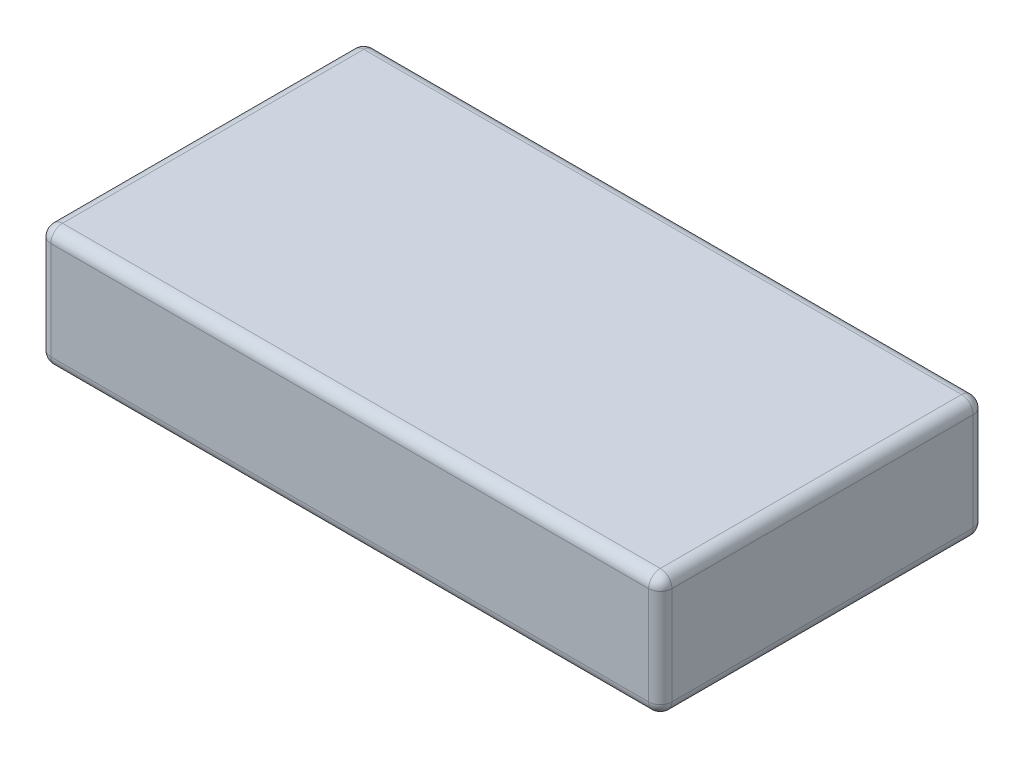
ISO-10303-21;
HEADER;
FILE_DESCRIPTION(('STEP AP214'),'2;1');
FILE_NAME('part.step','',(''),(''),'','','');
FILE_SCHEMA(('AUTOMOTIVE_DESIGN { 1 0 10303 214 1 1 1 1 }'));
ENDSEC;
DATA;
#1=APPLICATION_CONTEXT('core data for automotive mechanical design processes');
#2=APPLICATION_PROTOCOL_DEFINITION('international standard','automotive_design',2000,#1);
#3=PRODUCT_CONTEXT('',#1,'mechanical');
#4=PRODUCT('Part','Part','',(#3));
#5=PRODUCT_RELATED_PRODUCT_CATEGORY('part','',(#4));
#6=PRODUCT_DEFINITION_FORMATION('','',#4);
#7=PRODUCT_DEFINITION_CONTEXT('part definition',#1,'design');
#8=PRODUCT_DEFINITION('design','',#6,#7);
#9=PRODUCT_DEFINITION_SHAPE('','',#8);
#10=(LENGTH_UNIT() NAMED_UNIT(*) SI_UNIT(.MILLI.,.METRE.));
#11=(NAMED_UNIT(*) PLANE_ANGLE_UNIT() SI_UNIT($,.RADIAN.));
#12=(NAMED_UNIT(*) SI_UNIT($,.STERADIAN.) SOLID_ANGLE_UNIT());
#13=UNCERTAINTY_MEASURE_WITH_UNIT(LENGTH_MEASURE(1.E-05),#10,'distance_accuracy_value','');
#14=(GEOMETRIC_REPRESENTATION_CONTEXT(3) GLOBAL_UNCERTAINTY_ASSIGNED_CONTEXT((#13)) GLOBAL_UNIT_ASSIGNED_CONTEXT((#10,
#11,#12)) REPRESENTATION_CONTEXT('',''));
#15=CARTESIAN_POINT('',(0.,0.,0.));
#16=DIRECTION('',(0.,0.,1.));
#17=DIRECTION('',(1.,0.,0.));
#18=AXIS2_PLACEMENT_3D('',#15,#16,#17);
#19=CARTESIAN_POINT('',(26.6,10.4,13.9));
#20=DIRECTION('',(-1.,0.,0.));
#21=DIRECTION('',(0.,0.,1.));
#22=AXIS2_PLACEMENT_3D('',#19,#20,#21);
#23=PLANE('',#22);
#24=DIRECTION('',(0.,0.,-1.));
#25=VECTOR('',#24,1.);
#26=CARTESIAN_POINT('',(26.6,1.,-13.9));
#27=LINE('',#26,#25);
#28=CARTESIAN_POINT('',(26.6,1.,12.9));
#29=VERTEX_POINT('',#28);
#30=CARTESIAN_POINT('',(26.6,1.,-12.9));
#31=VERTEX_POINT('',#30);
#32=EDGE_CURVE('E227',#29,#31,#27,.T.);
#33=ORIENTED_EDGE('',*,*,#32,.T.);
#34=DIRECTION('',(0.,-1.,0.));
#35=VECTOR('',#34,1.);
#36=CARTESIAN_POINT('',(26.6,10.4,-12.9));
#37=LINE('',#36,#35);
#38=CARTESIAN_POINT('',(26.6,9.4,-12.9));
#39=VERTEX_POINT('',#38);
#40=EDGE_CURVE('E231',#31,#39,#37,.F.);
#41=ORIENTED_EDGE('',*,*,#40,.T.);
#42=DIRECTION('',(0.,0.,-1.));
#43=VECTOR('',#42,1.);
#44=CARTESIAN_POINT('',(26.6,9.4,13.9));
#45=LINE('',#44,#43);
#46=CARTESIAN_POINT('',(26.6,9.4,12.9));
#47=VERTEX_POINT('',#46);
#48=EDGE_CURVE('E224',#39,#47,#45,.F.);
#49=ORIENTED_EDGE('',*,*,#48,.T.);
#50=DIRECTION('',(0.,-1.,0.));
#51=VECTOR('',#50,1.);
#52=CARTESIAN_POINT('',(26.6,10.4,12.9));
#53=LINE('',#52,#51);
#54=EDGE_CURVE('E221',#47,#29,#53,.T.);
#55=ORIENTED_EDGE('',*,*,#54,.T.);
#56=EDGE_LOOP('',(#33,#41,#49,#55));
#57=FACE_BOUND('',#56,.T.);
#58=ADVANCED_FACE('F46',(#57),#23,.F.);
#59=CARTESIAN_POINT('',(-26.6,10.4,-13.9));
#60=DIRECTION('',(0.,0.,1.));
#61=DIRECTION('',(1.,0.,0.));
#62=AXIS2_PLACEMENT_3D('',#59,#60,#61);
#63=PLANE('',#62);
#64=DIRECTION('',(-1.,0.,0.));
#65=VECTOR('',#64,1.);
#66=CARTESIAN_POINT('',(-26.6,1.,-13.9));
#67=LINE('',#66,#65);
#68=CARTESIAN_POINT('',(25.6,1.,-13.9));
#69=VERTEX_POINT('',#68);
#70=CARTESIAN_POINT('',(-25.6,1.,-13.9));
#71=VERTEX_POINT('',#70);
#72=EDGE_CURVE('E147',#69,#71,#67,.T.);
#73=ORIENTED_EDGE('',*,*,#72,.T.);
#74=DIRECTION('',(0.,-1.,0.));
#75=VECTOR('',#74,1.);
#76=CARTESIAN_POINT('',(-25.6,10.4,-13.9));
#77=LINE('',#76,#75);
#78=CARTESIAN_POINT('',(-25.6,9.4,-13.9));
#79=VERTEX_POINT('',#78);
#80=EDGE_CURVE('E142',#71,#79,#77,.F.);
#81=ORIENTED_EDGE('',*,*,#80,.T.);
#82=DIRECTION('',(-1.,0.,0.));
#83=VECTOR('',#82,1.);
#84=CARTESIAN_POINT('',(-26.6,9.4,-13.9));
#85=LINE('',#84,#83);
#86=CARTESIAN_POINT('',(25.6,9.4,-13.9));
#87=VERTEX_POINT('',#86);
#88=EDGE_CURVE('E134',#79,#87,#85,.F.);
#89=ORIENTED_EDGE('',*,*,#88,.T.);
#90=DIRECTION('',(0.,-1.,0.));
#91=VECTOR('',#90,1.);
#92=CARTESIAN_POINT('',(25.6,10.4,-13.9));
#93=LINE('',#92,#91);
#94=EDGE_CURVE('E139',#87,#69,#93,.T.);
#95=ORIENTED_EDGE('',*,*,#94,.T.);
#96=EDGE_LOOP('',(#73,#81,#89,#95));
#97=FACE_BOUND('',#96,.T.);
#98=ADVANCED_FACE('F137',(#97),#63,.F.);
#99=CARTESIAN_POINT('',(-26.6,10.4,13.9));
#100=DIRECTION('',(1.,0.,0.));
#101=DIRECTION('',(0.,0.,-1.));
#102=AXIS2_PLACEMENT_3D('',#99,#100,#101);
#103=PLANE('',#102);
#104=DIRECTION('',(0.,0.,1.));
#105=VECTOR('',#104,1.);
#106=CARTESIAN_POINT('',(-26.6,1.,13.9));
#107=LINE('',#106,#105);
#108=CARTESIAN_POINT('',(-26.6,1.,-12.9));
#109=VERTEX_POINT('',#108);
#110=CARTESIAN_POINT('',(-26.6,1.,12.9));
#111=VERTEX_POINT('',#110);
#112=EDGE_CURVE('E201',#109,#111,#107,.T.);
#113=ORIENTED_EDGE('',*,*,#112,.T.);
#114=DIRECTION('',(0.,-1.,0.));
#115=VECTOR('',#114,1.);
#116=CARTESIAN_POINT('',(-26.6,10.4,12.9));
#117=LINE('',#116,#115);
#118=CARTESIAN_POINT('',(-26.6,9.4,12.9));
#119=VERTEX_POINT('',#118);
#120=EDGE_CURVE('E205',#111,#119,#117,.F.);
#121=ORIENTED_EDGE('',*,*,#120,.T.);
#122=DIRECTION('',(0.,0.,1.));
#123=VECTOR('',#122,1.);
#124=CARTESIAN_POINT('',(-26.6,9.4,13.9));
#125=LINE('',#124,#123);
#126=CARTESIAN_POINT('',(-26.6,9.4,-12.9));
#127=VERTEX_POINT('',#126);
#128=EDGE_CURVE('E198',#119,#127,#125,.F.);
#129=ORIENTED_EDGE('',*,*,#128,.T.);
#130=DIRECTION('',(0.,-1.,0.));
#131=VECTOR('',#130,1.);
#132=CARTESIAN_POINT('',(-26.6,10.4,-12.9));
#133=LINE('',#132,#131);
#134=EDGE_CURVE('E195',#127,#109,#133,.T.);
#135=ORIENTED_EDGE('',*,*,#134,.T.);
#136=EDGE_LOOP('',(#113,#121,#129,#135));
#137=FACE_BOUND('',#136,.T.);
#138=ADVANCED_FACE('F324',(#137),#103,.F.);
#139=CARTESIAN_POINT('',(-26.6,10.4,13.9));
#140=DIRECTION('',(0.,0.,-1.));
#141=DIRECTION('',(-1.,0.,0.));
#142=AXIS2_PLACEMENT_3D('',#139,#140,#141);
#143=PLANE('',#142);
#144=DIRECTION('',(1.,0.,0.));
#145=VECTOR('',#144,1.);
#146=CARTESIAN_POINT('',(-26.6,9.4,13.9));
#147=LINE('',#146,#145);
#148=CARTESIAN_POINT('',(25.6,9.4,13.9));
#149=VERTEX_POINT('',#148);
#150=CARTESIAN_POINT('',(-25.6,9.4,13.9));
#151=VERTEX_POINT('',#150);
#152=EDGE_CURVE('E211',#149,#151,#147,.F.);
#153=ORIENTED_EDGE('',*,*,#152,.T.);
#154=DIRECTION('',(0.,-1.,0.));
#155=VECTOR('',#154,1.);
#156=CARTESIAN_POINT('',(-25.6,10.4,13.9));
#157=LINE('',#156,#155);
#158=CARTESIAN_POINT('',(-25.6,1.,13.9));
#159=VERTEX_POINT('',#158);
#160=EDGE_CURVE('E218',#151,#159,#157,.T.);
#161=ORIENTED_EDGE('',*,*,#160,.T.);
#162=DIRECTION('',(1.,0.,0.));
#163=VECTOR('',#162,1.);
#164=CARTESIAN_POINT('',(26.6,1.,13.9));
#165=LINE('',#164,#163);
#166=CARTESIAN_POINT('',(25.6,1.,13.9));
#167=VERTEX_POINT('',#166);
#168=EDGE_CURVE('E214',#159,#167,#165,.T.);
#169=ORIENTED_EDGE('',*,*,#168,.T.);
#170=DIRECTION('',(0.,-1.,0.));
#171=VECTOR('',#170,1.);
#172=CARTESIAN_POINT('',(25.6,10.4,13.9));
#173=LINE('',#172,#171);
#174=EDGE_CURVE('E208',#167,#149,#173,.F.);
#175=ORIENTED_EDGE('',*,*,#174,.T.);
#176=EDGE_LOOP('',(#153,#161,#169,#175));
#177=FACE_BOUND('',#176,.T.);
#178=ADVANCED_FACE('F333',(#177),#143,.F.);
#179=CARTESIAN_POINT('',(0.,10.4,0.));
#180=DIRECTION('',(0.,-1.,0.));
#181=DIRECTION('',(0.,0.,-1.));
#182=AXIS2_PLACEMENT_3D('',#179,#180,#181);
#183=PLANE('',#182);
#184=DIRECTION('',(0.,0.,1.));
#185=VECTOR('',#184,1.);
#186=CARTESIAN_POINT('',(-25.6,10.4,0.));
#187=LINE('',#186,#185);
#188=CARTESIAN_POINT('',(-25.6,10.4,-12.9));
#189=VERTEX_POINT('',#188);
#190=CARTESIAN_POINT('',(-25.6,10.4,12.9));
#191=VERTEX_POINT('',#190);
#192=EDGE_CURVE('E56',#189,#191,#187,.T.);
#193=ORIENTED_EDGE('',*,*,#192,.T.);
#194=DIRECTION('',(1.,0.,0.));
#195=VECTOR('',#194,1.);
#196=CARTESIAN_POINT('',(0.,10.4,12.9));
#197=LINE('',#196,#195);
#198=CARTESIAN_POINT('',(25.6,10.4,12.9));
#199=VERTEX_POINT('',#198);
#200=EDGE_CURVE('E11',#191,#199,#197,.T.);
#201=ORIENTED_EDGE('',*,*,#200,.T.);
#202=DIRECTION('',(0.,0.,-1.));
#203=VECTOR('',#202,1.);
#204=CARTESIAN_POINT('',(25.6,10.4,0.));
#205=LINE('',#204,#203);
#206=CARTESIAN_POINT('',(25.6,10.4,-12.9));
#207=VERTEX_POINT('',#206);
#208=EDGE_CURVE('E234',#199,#207,#205,.T.);
#209=ORIENTED_EDGE('',*,*,#208,.T.);
#210=DIRECTION('',(-1.,0.,0.));
#211=VECTOR('',#210,1.);
#212=CARTESIAN_POINT('',(0.,10.4,-12.9));
#213=LINE('',#212,#211);
#214=EDGE_CURVE('E67',#207,#189,#213,.T.);
#215=ORIENTED_EDGE('',*,*,#214,.T.);
#216=EDGE_LOOP('',(#193,#201,#209,#215));
#217=FACE_BOUND('',#216,.T.);
#218=ADVANCED_FACE('F355',(#217),#183,.F.);
#219=CARTESIAN_POINT('',(0.,0.,0.));
#220=DIRECTION('',(0.,-1.,0.));
#221=DIRECTION('',(0.,0.,-1.));
#222=AXIS2_PLACEMENT_3D('',#219,#220,#221);
#223=PLANE('',#222);
#224=DIRECTION('',(0.,0.,1.));
#225=VECTOR('',#224,1.);
#226=CARTESIAN_POINT('',(-25.6,0.,-13.9));
#227=LINE('',#226,#225);
#228=CARTESIAN_POINT('',(-25.6,0.,12.9));
#229=VERTEX_POINT('',#228);
#230=CARTESIAN_POINT('',(-25.6,0.,-12.9));
#231=VERTEX_POINT('',#230);
#232=EDGE_CURVE('E188',#229,#231,#227,.F.);
#233=ORIENTED_EDGE('',*,*,#232,.T.);
#234=DIRECTION('',(-1.,0.,0.));
#235=VECTOR('',#234,1.);
#236=CARTESIAN_POINT('',(26.6,0.,-12.9));
#237=LINE('',#236,#235);
#238=CARTESIAN_POINT('',(25.6,0.,-12.9));
#239=VERTEX_POINT('',#238);
#240=EDGE_CURVE('E191',#231,#239,#237,.F.);
#241=ORIENTED_EDGE('',*,*,#240,.T.);
#242=DIRECTION('',(0.,0.,-1.));
#243=VECTOR('',#242,1.);
#244=CARTESIAN_POINT('',(25.6,0.,13.9));
#245=LINE('',#244,#243);
#246=CARTESIAN_POINT('',(25.6,0.,12.9));
#247=VERTEX_POINT('',#246);
#248=EDGE_CURVE('E182',#239,#247,#245,.F.);
#249=ORIENTED_EDGE('',*,*,#248,.T.);
#250=DIRECTION('',(1.,0.,0.));
#251=VECTOR('',#250,1.);
#252=CARTESIAN_POINT('',(-26.6,0.,12.9));
#253=LINE('',#252,#251);
#254=EDGE_CURVE('E185',#247,#229,#253,.F.);
#255=ORIENTED_EDGE('',*,*,#254,.T.);
#256=EDGE_LOOP('',(#233,#241,#249,#255));
#257=FACE_BOUND('',#256,.T.);
#258=ADVANCED_FACE('F357',(#257),#223,.T.);
#259=CARTESIAN_POINT('',(0.,9.4,12.9));
#260=DIRECTION('',(1.,0.,0.));
#261=DIRECTION('',(0.,0.,-1.));
#262=AXIS2_PLACEMENT_3D('',#259,#260,#261);
#263=CYLINDRICAL_SURFACE('',#262,1.);
#264=CARTESIAN_POINT('',(25.6,9.4,12.9));
#265=DIRECTION('',(1.,0.,0.));
#266=DIRECTION('',(0.,0.,-1.));
#267=AXIS2_PLACEMENT_3D('',#264,#265,#266);
#268=CIRCLE('',#267,1.);
#269=EDGE_CURVE('E50',#199,#149,#268,.T.);
#270=ORIENTED_EDGE('',*,*,#269,.F.);
#271=ORIENTED_EDGE('',*,*,#200,.F.);
#272=CARTESIAN_POINT('',(-25.6,9.4,12.9));
#273=DIRECTION('',(-1.,0.,0.));
#274=DIRECTION('',(0.,0.,1.));
#275=AXIS2_PLACEMENT_3D('',#272,#273,#274);
#276=CIRCLE('',#275,1.);
#277=EDGE_CURVE('E176',#151,#191,#276,.T.);
#278=ORIENTED_EDGE('',*,*,#277,.F.);
#279=ORIENTED_EDGE('',*,*,#152,.F.);
#280=EDGE_LOOP('',(#270,#271,#278,#279));
#281=FACE_BOUND('',#280,.T.);
#282=ADVANCED_FACE('F48',(#281),#263,.T.);
#283=CARTESIAN_POINT('',(25.6,9.4,12.9));
#284=DIRECTION('',(0.,0.,1.));
#285=DIRECTION('',(1.,0.,0.));
#286=AXIS2_PLACEMENT_3D('',#283,#284,#285);
#287=SPHERICAL_SURFACE('',#286,1.);
#288=CARTESIAN_POINT('',(25.6,9.4,12.9));
#289=DIRECTION('',(0.,0.,1.));
#290=DIRECTION('',(1.,0.,0.));
#291=AXIS2_PLACEMENT_3D('',#288,#289,#290);
#292=CIRCLE('',#291,1.);
#293=EDGE_CURVE('E301',#199,#47,#292,.F.);
#294=ORIENTED_EDGE('',*,*,#293,.F.);
#295=ORIENTED_EDGE('',*,*,#269,.T.);
#296=CARTESIAN_POINT('',(25.6,9.4,12.9));
#297=DIRECTION('',(0.,1.,0.));
#298=DIRECTION('',(0.,0.,1.));
#299=AXIS2_PLACEMENT_3D('',#296,#297,#298);
#300=CIRCLE('',#299,1.);
#301=EDGE_CURVE('E305',#47,#149,#300,.F.);
#302=ORIENTED_EDGE('',*,*,#301,.F.);
#303=EDGE_LOOP('',(#294,#295,#302));
#304=FACE_BOUND('',#303,.T.);
#305=ADVANCED_FACE('F351',(#304),#287,.T.);
#306=CARTESIAN_POINT('',(-25.6,9.4,12.9));
#307=DIRECTION('',(0.,1.,0.));
#308=DIRECTION('',(0.,0.,1.));
#309=AXIS2_PLACEMENT_3D('',#306,#307,#308);
#310=SPHERICAL_SURFACE('',#309,1.);
#311=CARTESIAN_POINT('',(-25.6,9.4,12.9));
#312=DIRECTION('',(0.,1.,0.));
#313=DIRECTION('',(0.,0.,1.));
#314=AXIS2_PLACEMENT_3D('',#311,#312,#313);
#315=CIRCLE('',#314,1.);
#316=EDGE_CURVE('E293',#151,#119,#315,.F.);
#317=ORIENTED_EDGE('',*,*,#316,.F.);
#318=ORIENTED_EDGE('',*,*,#277,.T.);
#319=CARTESIAN_POINT('',(-25.6,9.4,12.9));
#320=DIRECTION('',(0.,0.,1.));
#321=DIRECTION('',(1.,0.,0.));
#322=AXIS2_PLACEMENT_3D('',#319,#320,#321);
#323=CIRCLE('',#322,1.);
#324=EDGE_CURVE('E297',#119,#191,#323,.F.);
#325=ORIENTED_EDGE('',*,*,#324,.F.);
#326=EDGE_LOOP('',(#317,#318,#325));
#327=FACE_BOUND('',#326,.T.);
#328=ADVANCED_FACE('F314',(#327),#310,.T.);
#329=CARTESIAN_POINT('',(25.6,10.4,12.9));
#330=DIRECTION('',(0.,-1.,0.));
#331=DIRECTION('',(0.,0.,-1.));
#332=AXIS2_PLACEMENT_3D('',#329,#330,#331);
#333=CYLINDRICAL_SURFACE('',#332,1.);
#334=ORIENTED_EDGE('',*,*,#301,.T.);
#335=ORIENTED_EDGE('',*,*,#174,.F.);
#336=CARTESIAN_POINT('',(25.6,1.,12.9));
#337=DIRECTION('',(0.,-1.,0.));
#338=DIRECTION('',(0.,0.,-1.));
#339=AXIS2_PLACEMENT_3D('',#336,#337,#338);
#340=CIRCLE('',#339,1.);
#341=EDGE_CURVE('E286',#29,#167,#340,.T.);
#342=ORIENTED_EDGE('',*,*,#341,.F.);
#343=ORIENTED_EDGE('',*,*,#54,.F.);
#344=EDGE_LOOP('',(#334,#335,#342,#343));
#345=FACE_BOUND('',#344,.T.);
#346=ADVANCED_FACE('F345',(#345),#333,.T.);
#347=CARTESIAN_POINT('',(25.6,9.4,0.));
#348=DIRECTION('',(0.,0.,-1.));
#349=DIRECTION('',(-1.,0.,0.));
#350=AXIS2_PLACEMENT_3D('',#347,#348,#349);
#351=CYLINDRICAL_SURFACE('',#350,1.);
#352=ORIENTED_EDGE('',*,*,#293,.T.);
#353=ORIENTED_EDGE('',*,*,#48,.F.);
#354=CARTESIAN_POINT('',(25.6,9.4,-12.9));
#355=DIRECTION('',(0.,0.,-1.));
#356=DIRECTION('',(-1.,0.,0.));
#357=AXIS2_PLACEMENT_3D('',#354,#355,#356);
#358=CIRCLE('',#357,1.);
#359=EDGE_CURVE('E157',#207,#39,#358,.T.);
#360=ORIENTED_EDGE('',*,*,#359,.F.);
#361=ORIENTED_EDGE('',*,*,#208,.F.);
#362=EDGE_LOOP('',(#352,#353,#360,#361));
#363=FACE_BOUND('',#362,.T.);
#364=ADVANCED_FACE('F354',(#363),#351,.T.);
#365=CARTESIAN_POINT('',(0.,9.4,-12.9));
#366=DIRECTION('',(-1.,0.,0.));
#367=DIRECTION('',(0.,0.,1.));
#368=AXIS2_PLACEMENT_3D('',#365,#366,#367);
#369=CYLINDRICAL_SURFACE('',#368,1.);
#370=CARTESIAN_POINT('',(-25.6,9.4,-12.9));
#371=DIRECTION('',(-1.,0.,0.));
#372=DIRECTION('',(0.,0.,1.));
#373=AXIS2_PLACEMENT_3D('',#370,#371,#372);
#374=CIRCLE('',#373,1.);
#375=EDGE_CURVE('E158',#189,#79,#374,.T.);
#376=ORIENTED_EDGE('',*,*,#375,.F.);
#377=ORIENTED_EDGE('',*,*,#214,.F.);
#378=CARTESIAN_POINT('',(25.6,9.4,-12.9));
#379=DIRECTION('',(1.,0.,0.));
#380=DIRECTION('',(0.,0.,-1.));
#381=AXIS2_PLACEMENT_3D('',#378,#379,#380);
#382=CIRCLE('',#381,1.);
#383=EDGE_CURVE('E150',#87,#207,#382,.T.);
#384=ORIENTED_EDGE('',*,*,#383,.F.);
#385=ORIENTED_EDGE('',*,*,#88,.F.);
#386=EDGE_LOOP('',(#376,#377,#384,#385));
#387=FACE_BOUND('',#386,.T.);
#388=ADVANCED_FACE('F152',(#387),#369,.T.);
#389=CARTESIAN_POINT('',(-25.6,9.4,0.));
#390=DIRECTION('',(0.,0.,1.));
#391=DIRECTION('',(1.,0.,0.));
#392=AXIS2_PLACEMENT_3D('',#389,#390,#391);
#393=CYLINDRICAL_SURFACE('',#392,1.);
#394=ORIENTED_EDGE('',*,*,#324,.T.);
#395=ORIENTED_EDGE('',*,*,#192,.F.);
#396=CARTESIAN_POINT('',(-25.6,9.4,-12.9));
#397=DIRECTION('',(0.,0.,-1.));
#398=DIRECTION('',(-1.,0.,0.));
#399=AXIS2_PLACEMENT_3D('',#396,#397,#398);
#400=CIRCLE('',#399,1.);
#401=EDGE_CURVE('E278',#127,#189,#400,.T.);
#402=ORIENTED_EDGE('',*,*,#401,.F.);
#403=ORIENTED_EDGE('',*,*,#128,.F.);
#404=EDGE_LOOP('',(#394,#395,#402,#403));
#405=FACE_BOUND('',#404,.T.);
#406=ADVANCED_FACE('F320',(#405),#393,.T.);
#407=CARTESIAN_POINT('',(-25.6,10.4,12.9));
#408=DIRECTION('',(0.,-1.,0.));
#409=DIRECTION('',(0.,0.,-1.));
#410=AXIS2_PLACEMENT_3D('',#407,#408,#409);
#411=CYLINDRICAL_SURFACE('',#410,1.);
#412=ORIENTED_EDGE('',*,*,#316,.T.);
#413=ORIENTED_EDGE('',*,*,#120,.F.);
#414=CARTESIAN_POINT('',(-25.6,1.,12.9));
#415=DIRECTION('',(0.,-1.,0.));
#416=DIRECTION('',(0.,0.,-1.));
#417=AXIS2_PLACEMENT_3D('',#414,#415,#416);
#418=CIRCLE('',#417,1.);
#419=EDGE_CURVE('E274',#159,#111,#418,.T.);
#420=ORIENTED_EDGE('',*,*,#419,.F.);
#421=ORIENTED_EDGE('',*,*,#160,.F.);
#422=EDGE_LOOP('',(#412,#413,#420,#421));
#423=FACE_BOUND('',#422,.T.);
#424=ADVANCED_FACE('F330',(#423),#411,.T.);
#425=CARTESIAN_POINT('',(-26.6,1.,12.9));
#426=DIRECTION('',(-1.,0.,0.));
#427=DIRECTION('',(0.,0.,1.));
#428=AXIS2_PLACEMENT_3D('',#425,#426,#427);
#429=CYLINDRICAL_SURFACE('',#428,1.);
#430=CARTESIAN_POINT('',(25.6,1.,12.9));
#431=DIRECTION('',(1.,0.,0.));
#432=DIRECTION('',(0.,0.,-1.));
#433=AXIS2_PLACEMENT_3D('',#430,#431,#432);
#434=CIRCLE('',#433,1.);
#435=EDGE_CURVE('E289',#167,#247,#434,.T.);
#436=ORIENTED_EDGE('',*,*,#435,.F.);
#437=ORIENTED_EDGE('',*,*,#168,.F.);
#438=CARTESIAN_POINT('',(-25.6,1.,12.9));
#439=DIRECTION('',(-1.,0.,0.));
#440=DIRECTION('',(0.,0.,1.));
#441=AXIS2_PLACEMENT_3D('',#438,#439,#440);
#442=CIRCLE('',#441,1.);
#443=EDGE_CURVE('E270',#229,#159,#442,.T.);
#444=ORIENTED_EDGE('',*,*,#443,.F.);
#445=ORIENTED_EDGE('',*,*,#254,.F.);
#446=EDGE_LOOP('',(#436,#437,#444,#445));
#447=FACE_BOUND('',#446,.T.);
#448=ADVANCED_FACE('F337',(#447),#429,.T.);
#449=CARTESIAN_POINT('',(25.6,1.,12.9));
#450=DIRECTION('',(0.,0.,1.));
#451=DIRECTION('',(0.,-1.,0.));
#452=AXIS2_PLACEMENT_3D('',#449,#450,#451);
#453=SPHERICAL_SURFACE('',#452,1.);
#454=ORIENTED_EDGE('',*,*,#341,.T.);
#455=ORIENTED_EDGE('',*,*,#435,.T.);
#456=CARTESIAN_POINT('',(25.6,1.,12.9));
#457=DIRECTION('',(0.,0.,1.));
#458=DIRECTION('',(1.,0.,0.));
#459=AXIS2_PLACEMENT_3D('',#456,#457,#458);
#460=CIRCLE('',#459,1.);
#461=EDGE_CURVE('E166',#29,#247,#460,.F.);
#462=ORIENTED_EDGE('',*,*,#461,.F.);
#463=EDGE_LOOP('',(#454,#455,#462));
#464=FACE_BOUND('',#463,.T.);
#465=ADVANCED_FACE('F411',(#464),#453,.T.);
#466=CARTESIAN_POINT('',(25.6,9.4,-12.9));
#467=DIRECTION('',(0.,1.,0.));
#468=DIRECTION('',(0.,0.,1.));
#469=AXIS2_PLACEMENT_3D('',#466,#467,#468);
#470=SPHERICAL_SURFACE('',#469,1.);
#471=ORIENTED_EDGE('',*,*,#383,.T.);
#472=ORIENTED_EDGE('',*,*,#359,.T.);
#473=CARTESIAN_POINT('',(25.6,9.4,-12.9));
#474=DIRECTION('',(0.,1.,0.));
#475=DIRECTION('',(0.,0.,1.));
#476=AXIS2_PLACEMENT_3D('',#473,#474,#475);
#477=CIRCLE('',#476,1.);
#478=EDGE_CURVE('E161',#87,#39,#477,.F.);
#479=ORIENTED_EDGE('',*,*,#478,.F.);
#480=EDGE_LOOP('',(#471,#472,#479));
#481=FACE_BOUND('',#480,.T.);
#482=ADVANCED_FACE('F162',(#481),#470,.T.);
#483=CARTESIAN_POINT('',(-25.6,9.4,-12.9));
#484=DIRECTION('',(0.,1.,0.));
#485=DIRECTION('',(0.,0.,1.));
#486=AXIS2_PLACEMENT_3D('',#483,#484,#485);
#487=SPHERICAL_SURFACE('',#486,1.);
#488=ORIENTED_EDGE('',*,*,#401,.T.);
#489=ORIENTED_EDGE('',*,*,#375,.T.);
#490=CARTESIAN_POINT('',(-25.6,9.4,-12.9));
#491=DIRECTION('',(0.,1.,0.));
#492=DIRECTION('',(0.,0.,1.));
#493=AXIS2_PLACEMENT_3D('',#490,#491,#492);
#494=CIRCLE('',#493,1.);
#495=EDGE_CURVE('E167',#127,#79,#494,.F.);
#496=ORIENTED_EDGE('',*,*,#495,.F.);
#497=EDGE_LOOP('',(#488,#489,#496));
#498=FACE_BOUND('',#497,.T.);
#499=ADVANCED_FACE('F404',(#498),#487,.T.);
#500=CARTESIAN_POINT('',(-25.6,1.,12.9));
#501=DIRECTION('',(0.,0.,1.));
#502=DIRECTION('',(0.,-1.,0.));
#503=AXIS2_PLACEMENT_3D('',#500,#501,#502);
#504=SPHERICAL_SURFACE('',#503,1.);
#505=ORIENTED_EDGE('',*,*,#443,.T.);
#506=ORIENTED_EDGE('',*,*,#419,.T.);
#507=CARTESIAN_POINT('',(-25.6,1.,12.9));
#508=DIRECTION('',(0.,0.,1.));
#509=DIRECTION('',(1.,0.,0.));
#510=AXIS2_PLACEMENT_3D('',#507,#508,#509);
#511=CIRCLE('',#510,1.);
#512=EDGE_CURVE('E261',#229,#111,#511,.F.);
#513=ORIENTED_EDGE('',*,*,#512,.F.);
#514=EDGE_LOOP('',(#505,#506,#513));
#515=FACE_BOUND('',#514,.T.);
#516=ADVANCED_FACE('F400',(#515),#504,.T.);
#517=CARTESIAN_POINT('',(25.6,1.,13.9));
#518=DIRECTION('',(0.,0.,1.));
#519=DIRECTION('',(1.,0.,0.));
#520=AXIS2_PLACEMENT_3D('',#517,#518,#519);
#521=CYLINDRICAL_SURFACE('',#520,1.);
#522=ORIENTED_EDGE('',*,*,#461,.T.);
#523=ORIENTED_EDGE('',*,*,#248,.F.);
#524=CARTESIAN_POINT('',(25.6,1.,-12.9));
#525=DIRECTION('',(0.,0.,-1.));
#526=DIRECTION('',(-1.,0.,0.));
#527=AXIS2_PLACEMENT_3D('',#524,#525,#526);
#528=CIRCLE('',#527,1.);
#529=EDGE_CURVE('E257',#31,#239,#528,.T.);
#530=ORIENTED_EDGE('',*,*,#529,.F.);
#531=ORIENTED_EDGE('',*,*,#32,.F.);
#532=EDGE_LOOP('',(#522,#523,#530,#531));
#533=FACE_BOUND('',#532,.T.);
#534=ADVANCED_FACE('F397',(#533),#521,.T.);
#535=CARTESIAN_POINT('',(25.6,10.4,-12.9));
#536=DIRECTION('',(0.,-1.,0.));
#537=DIRECTION('',(0.,0.,-1.));
#538=AXIS2_PLACEMENT_3D('',#535,#536,#537);
#539=CYLINDRICAL_SURFACE('',#538,1.);
#540=ORIENTED_EDGE('',*,*,#478,.T.);
#541=ORIENTED_EDGE('',*,*,#40,.F.);
#542=CARTESIAN_POINT('',(25.6,1.,-12.9));
#543=DIRECTION('',(0.,-1.,0.));
#544=DIRECTION('',(0.,0.,-1.));
#545=AXIS2_PLACEMENT_3D('',#542,#543,#544);
#546=CIRCLE('',#545,1.);
#547=EDGE_CURVE('E170',#69,#31,#546,.T.);
#548=ORIENTED_EDGE('',*,*,#547,.F.);
#549=ORIENTED_EDGE('',*,*,#94,.F.);
#550=EDGE_LOOP('',(#540,#541,#548,#549));
#551=FACE_BOUND('',#550,.T.);
#552=ADVANCED_FACE('F169',(#551),#539,.T.);
#553=CARTESIAN_POINT('',(-25.6,10.4,-12.9));
#554=DIRECTION('',(0.,-1.,0.));
#555=DIRECTION('',(0.,0.,-1.));
#556=AXIS2_PLACEMENT_3D('',#553,#554,#555);
#557=CYLINDRICAL_SURFACE('',#556,1.);
#558=ORIENTED_EDGE('',*,*,#495,.T.);
#559=ORIENTED_EDGE('',*,*,#80,.F.);
#560=CARTESIAN_POINT('',(-25.6,1.,-12.9));
#561=DIRECTION('',(0.,-1.,0.));
#562=DIRECTION('',(0.,0.,-1.));
#563=AXIS2_PLACEMENT_3D('',#560,#561,#562);
#564=CIRCLE('',#563,1.);
#565=EDGE_CURVE('E251',#109,#71,#564,.T.);
#566=ORIENTED_EDGE('',*,*,#565,.F.);
#567=ORIENTED_EDGE('',*,*,#134,.F.);
#568=EDGE_LOOP('',(#558,#559,#566,#567));
#569=FACE_BOUND('',#568,.T.);
#570=ADVANCED_FACE('F390',(#569),#557,.T.);
#571=CARTESIAN_POINT('',(-25.6,1.,13.9));
#572=DIRECTION('',(0.,0.,-1.));
#573=DIRECTION('',(-1.,0.,0.));
#574=AXIS2_PLACEMENT_3D('',#571,#572,#573);
#575=CYLINDRICAL_SURFACE('',#574,1.);
#576=ORIENTED_EDGE('',*,*,#512,.T.);
#577=ORIENTED_EDGE('',*,*,#112,.F.);
#578=CARTESIAN_POINT('',(-25.6,1.,-12.9));
#579=DIRECTION('',(0.,0.,-1.));
#580=DIRECTION('',(-1.,0.,0.));
#581=AXIS2_PLACEMENT_3D('',#578,#579,#580);
#582=CIRCLE('',#581,1.);
#583=EDGE_CURVE('E247',#231,#109,#582,.T.);
#584=ORIENTED_EDGE('',*,*,#583,.F.);
#585=ORIENTED_EDGE('',*,*,#232,.F.);
#586=EDGE_LOOP('',(#576,#577,#584,#585));
#587=FACE_BOUND('',#586,.T.);
#588=ADVANCED_FACE('F386',(#587),#575,.T.);
#589=CARTESIAN_POINT('',(25.6,1.,-12.9));
#590=DIRECTION('',(1.,0.,0.));
#591=DIRECTION('',(0.,1.,0.));
#592=AXIS2_PLACEMENT_3D('',#589,#590,#591);
#593=SPHERICAL_SURFACE('',#592,1.);
#594=ORIENTED_EDGE('',*,*,#547,.T.);
#595=ORIENTED_EDGE('',*,*,#529,.T.);
#596=CARTESIAN_POINT('',(25.6,1.,-12.9));
#597=DIRECTION('',(1.,0.,0.));
#598=DIRECTION('',(0.,0.,-1.));
#599=AXIS2_PLACEMENT_3D('',#596,#597,#598);
#600=CIRCLE('',#599,1.);
#601=EDGE_CURVE('E244',#69,#239,#600,.F.);
#602=ORIENTED_EDGE('',*,*,#601,.F.);
#603=EDGE_LOOP('',(#594,#595,#602));
#604=FACE_BOUND('',#603,.T.);
#605=ADVANCED_FACE('F382',(#604),#593,.T.);
#606=CARTESIAN_POINT('',(-25.6,1.,-12.9));
#607=DIRECTION('',(-1.,0.,0.));
#608=DIRECTION('',(0.,-1.,0.));
#609=AXIS2_PLACEMENT_3D('',#606,#607,#608);
#610=SPHERICAL_SURFACE('',#609,1.);
#611=ORIENTED_EDGE('',*,*,#583,.T.);
#612=ORIENTED_EDGE('',*,*,#565,.T.);
#613=CARTESIAN_POINT('',(-25.6,1.,-12.9));
#614=DIRECTION('',(-1.,0.,0.));
#615=DIRECTION('',(0.,0.,1.));
#616=AXIS2_PLACEMENT_3D('',#613,#614,#615);
#617=CIRCLE('',#616,1.);
#618=EDGE_CURVE('E241',#231,#71,#617,.F.);
#619=ORIENTED_EDGE('',*,*,#618,.F.);
#620=EDGE_LOOP('',(#611,#612,#619));
#621=FACE_BOUND('',#620,.T.);
#622=ADVANCED_FACE('F378',(#621),#610,.T.);
#623=CARTESIAN_POINT('',(-26.6,1.,-12.9));
#624=DIRECTION('',(1.,0.,0.));
#625=DIRECTION('',(0.,0.,-1.));
#626=AXIS2_PLACEMENT_3D('',#623,#624,#625);
#627=CYLINDRICAL_SURFACE('',#626,1.);
#628=ORIENTED_EDGE('',*,*,#601,.T.);
#629=ORIENTED_EDGE('',*,*,#240,.F.);
#630=ORIENTED_EDGE('',*,*,#618,.T.);
#631=ORIENTED_EDGE('',*,*,#72,.F.);
#632=EDGE_LOOP('',(#628,#629,#630,#631));
#633=FACE_BOUND('',#632,.T.);
#634=ADVANCED_FACE('F375',(#633),#627,.T.);
#635=CLOSED_SHELL('',(#58,#98,#138,#178,#218,#258,#282,#305,#328,#346,#364,#388,#406,#424,#448,
#465,#482,#499,#516,#534,#552,#570,#588,#605,#622,#634));
#636=MANIFOLD_SOLID_BREP('B2',#635);
#637=ADVANCED_BREP_SHAPE_REPRESENTATION('',(#18,#636),#14);
#638=SHAPE_DEFINITION_REPRESENTATION(#9,#637);
ENDSEC;
END-ISO-10303-21;
